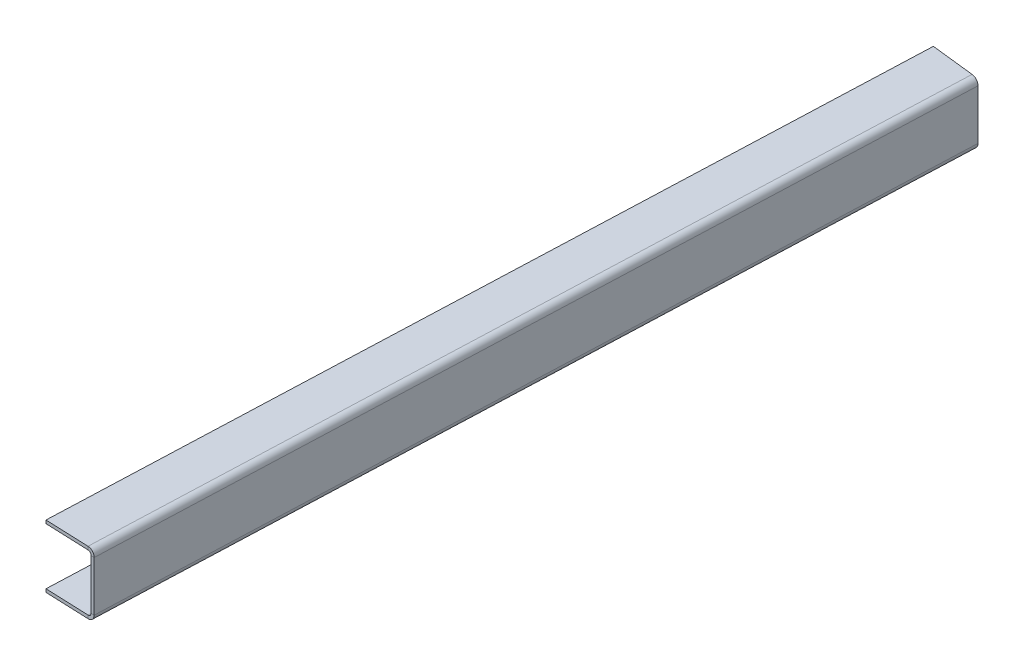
ISO-10303-21;
HEADER;
FILE_DESCRIPTION(('STEP AP214'),'2;1');
FILE_NAME('part.step','',(''),(''),'','','');
FILE_SCHEMA(('AUTOMOTIVE_DESIGN { 1 0 10303 214 1 1 1 1 }'));
ENDSEC;
DATA;
#1=APPLICATION_CONTEXT('core data for automotive mechanical design processes');
#2=APPLICATION_PROTOCOL_DEFINITION('international standard','automotive_design',2000,#1);
#3=PRODUCT_CONTEXT('',#1,'mechanical');
#4=PRODUCT('Part','Part','',(#3));
#5=PRODUCT_RELATED_PRODUCT_CATEGORY('part','',(#4));
#6=PRODUCT_DEFINITION_FORMATION('','',#4);
#7=PRODUCT_DEFINITION_CONTEXT('part definition',#1,'design');
#8=PRODUCT_DEFINITION('design','',#6,#7);
#9=PRODUCT_DEFINITION_SHAPE('','',#8);
#10=(LENGTH_UNIT() NAMED_UNIT(*) SI_UNIT(.MILLI.,.METRE.));
#11=(NAMED_UNIT(*) PLANE_ANGLE_UNIT() SI_UNIT($,.RADIAN.));
#12=(NAMED_UNIT(*) SI_UNIT($,.STERADIAN.) SOLID_ANGLE_UNIT());
#13=UNCERTAINTY_MEASURE_WITH_UNIT(LENGTH_MEASURE(1.E-05),#10,'distance_accuracy_value','');
#14=(GEOMETRIC_REPRESENTATION_CONTEXT(3) GLOBAL_UNCERTAINTY_ASSIGNED_CONTEXT((#13)) GLOBAL_UNIT_ASSIGNED_CONTEXT((#10,
#11,#12)) REPRESENTATION_CONTEXT('',''));
#15=CARTESIAN_POINT('',(0.,0.,0.));
#16=DIRECTION('',(0.,0.,1.));
#17=DIRECTION('',(1.,0.,0.));
#18=AXIS2_PLACEMENT_3D('',#15,#16,#17);
#19=CARTESIAN_POINT('',(554.128349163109,0.,-136.07871295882));
#20=DIRECTION('',(0.0392134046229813,0.,-0.999230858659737));
#21=DIRECTION('',(0.,1.,0.));
#22=AXIS2_PLACEMENT_3D('',#19,#20,#21);
#23=PLANE('',#22);
#24=DIRECTION('',(-0.999230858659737,0.,-0.0392134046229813));
#25=VECTOR('',#24,1.);
#26=CARTESIAN_POINT('',(554.128349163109,607.963803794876,-136.07871295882));
#27=LINE('',#26,#25);
#28=CARTESIAN_POINT('',(555.752698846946,607.963803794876,-136.014967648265));
#29=VERTEX_POINT('',#28);
#30=CARTESIAN_POINT('',(554.128349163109,607.963803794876,-136.07871295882));
#31=VERTEX_POINT('',#30);
#32=EDGE_CURVE('E12',#29,#31,#27,.T.);
#33=ORIENTED_EDGE('',*,*,#32,.F.);
#34=DIRECTION('',(0.,1.,0.));
#35=VECTOR('',#34,1.);
#36=CARTESIAN_POINT('',(555.752698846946,0.,-136.014967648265));
#37=LINE('',#36,#35);
#38=CARTESIAN_POINT('',(555.752698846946,633.211403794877,-136.014967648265));
#39=VERTEX_POINT('',#38);
#40=EDGE_CURVE('E137',#29,#39,#37,.T.);
#41=ORIENTED_EDGE('',*,*,#40,.T.);
#42=DIRECTION('',(-0.999230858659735,0.,-0.0392134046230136));
#43=VECTOR('',#42,1.);
#44=CARTESIAN_POINT('',(554.128349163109,633.211403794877,-136.07871295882));
#45=LINE('',#44,#43);
#46=CARTESIAN_POINT('',(554.128349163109,633.211403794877,-136.07871295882));
#47=VERTEX_POINT('',#46);
#48=EDGE_CURVE('E90',#39,#47,#45,.T.);
#49=ORIENTED_EDGE('',*,*,#48,.T.);
#50=DIRECTION('',(0.,1.,0.));
#51=VECTOR('',#50,1.);
#52=CARTESIAN_POINT('',(554.128349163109,0.,-136.07871295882));
#53=LINE('',#52,#51);
#54=EDGE_CURVE('E139',#31,#47,#53,.T.);
#55=ORIENTED_EDGE('',*,*,#54,.F.);
#56=EDGE_LOOP('',(#33,#41,#49,#55));
#57=FACE_BOUND('',#56,.T.);
#58=ADVANCED_FACE('F78',(#57),#23,.F.);
#59=CARTESIAN_POINT('',(550.879720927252,633.211403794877,-136.208016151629));
#60=CARTESIAN_POINT('',(550.33827103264,633.211403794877,-136.229264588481));
#61=CARTESIAN_POINT('',(549.796821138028,633.211403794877,-136.250513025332));
#62=CARTESIAN_POINT('',(549.255371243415,633.211403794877,-136.271761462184));
#63=CARTESIAN_POINT('',(550.879720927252,629.960203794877,-136.208016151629));
#64=CARTESIAN_POINT('',(550.33827103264,628.876470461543,-136.229264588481));
#65=CARTESIAN_POINT('',(549.796821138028,627.79273712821,-136.250513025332));
#66=CARTESIAN_POINT('',(549.255371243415,626.709003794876,-136.271761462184));
#67=CARTESIAN_POINT('',(554.128349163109,629.960203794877,-136.07871295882));
#68=CARTESIAN_POINT('',(554.669799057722,628.876470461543,-136.057464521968));
#69=CARTESIAN_POINT('',(555.211248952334,627.79273712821,-136.036216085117));
#70=CARTESIAN_POINT('',(555.752698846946,626.709003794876,-136.014967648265));
#71=CARTESIAN_POINT('',(554.128349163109,633.211403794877,-136.07871295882));
#72=CARTESIAN_POINT('',(554.669799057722,633.211403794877,-136.057464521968));
#73=CARTESIAN_POINT('',(555.211248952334,633.211403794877,-136.036216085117));
#74=CARTESIAN_POINT('',(555.752698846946,633.211403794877,-136.014967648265));
#75=CARTESIAN_POINT('',(554.128349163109,636.462603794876,-136.07871295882));
#76=CARTESIAN_POINT('',(554.669799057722,637.54633712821,-136.057464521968));
#77=CARTESIAN_POINT('',(555.211248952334,638.630070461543,-136.036216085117));
#78=CARTESIAN_POINT('',(555.752698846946,639.713803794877,-136.014967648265));
#79=CARTESIAN_POINT('',(550.879720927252,636.462603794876,-136.208016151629));
#80=CARTESIAN_POINT('',(550.33827103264,637.54633712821,-136.229264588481));
#81=CARTESIAN_POINT('',(549.796821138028,638.630070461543,-136.250513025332));
#82=CARTESIAN_POINT('',(549.255371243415,639.713803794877,-136.271761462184));
#83=CARTESIAN_POINT('',(550.879720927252,633.211403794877,-136.208016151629));
#84=CARTESIAN_POINT('',(550.33827103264,633.211403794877,-136.229264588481));
#85=CARTESIAN_POINT('',(549.796821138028,633.211403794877,-136.250513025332));
#86=CARTESIAN_POINT('',(549.255371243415,633.211403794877,-136.271761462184));
#87=(BOUNDED_SURFACE() B_SPLINE_SURFACE(3,3,((#59,#60,#61,#62),(#63,#64,#65,#66),(#67,#68,#69,
#70),(#71,#72,#73,#74),(#75,#76,#77,#78),(#79,#80,#81,#82),(#83,#84,#85,#86)),.UNSPECIFIED.,.T.,
.F.,.F.) B_SPLINE_SURFACE_WITH_KNOTS((4,3,4),(4,4),(0.,0.5,1.),(0.,1.),
.UNSPECIFIED.) GEOMETRIC_REPRESENTATION_ITEM() RATIONAL_B_SPLINE_SURFACE(((1.,1.,1.,1.),
(0.333333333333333,0.333333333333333,0.333333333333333,0.333333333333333),(0.333333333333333,
0.333333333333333,0.333333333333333,0.333333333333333),(1.,1.,1.,1.),(0.333333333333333,
0.333333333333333,0.333333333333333,0.333333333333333),(0.333333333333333,0.333333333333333,
0.333333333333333,0.333333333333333),(1.,1.,1.,1.))) REPRESENTATION_ITEM('') SURFACE());
#88=CARTESIAN_POINT('',(552.504035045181,633.211403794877,-136.143364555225));
#89=DIRECTION('',(-0.0394921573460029,0.,0.999219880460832));
#90=DIRECTION('',(-0.999219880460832,0.,-0.0394921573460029));
#91=AXIS2_PLACEMENT_3D('',#88,#89,#90);
#92=ELLIPSE('',#91,3.25120012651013,3.2512);
#93=CARTESIAN_POINT('',(552.504035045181,636.462603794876,-136.143364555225));
#94=VERTEX_POINT('',#93);
#95=EDGE_CURVE('E215',#39,#94,#92,.T.);
#96=DIRECTION('',(0.,-1.,0.));
#97=VECTOR('',#96,1.);
#98=CARTESIAN_POINT('',(552.504035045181,634.837003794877,-136.143364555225));
#99=LINE('',#98,#97);
#100=CARTESIAN_POINT('',(552.504035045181,634.837003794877,-136.143364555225));
#101=VERTEX_POINT('',#100);
#102=EDGE_CURVE('E205',#94,#101,#99,.T.);
#103=CARTESIAN_POINT('',(552.504035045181,633.211403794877,-136.143364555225));
#104=DIRECTION('',(-0.0397709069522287,0.,0.999208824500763));
#105=DIRECTION('',(-0.999208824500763,0.,-0.0397709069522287));
#106=AXIS2_PLACEMENT_3D('',#103,#104,#105);
#107=ELLIPSE('',#106,1.62560025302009,1.6256);
#108=EDGE_CURVE('E213',#47,#101,#107,.T.);
#109=ORIENTED_EDGE('',*,*,#48,.F.);
#110=ORIENTED_EDGE('',*,*,#95,.T.);
#111=ORIENTED_EDGE('',*,*,#102,.T.);
#112=ORIENTED_EDGE('',*,*,#108,.F.);
#113=EDGE_LOOP('',(#109,#110,#111,#112));
#114=FACE_BOUND('',#113,.T.);
#115=ADVANCED_FACE('F212',(#114),#87,.F.);
#116=CARTESIAN_POINT('',(530.368364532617,634.837003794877,-137.024417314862));
#117=DIRECTION('',(-0.0397709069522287,0.,0.999208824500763));
#118=DIRECTION('',(0.999208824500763,0.,0.0397709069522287));
#119=AXIS2_PLACEMENT_3D('',#116,#117,#118);
#120=PLANE('',#119);
#121=ORIENTED_EDGE('',*,*,#102,.F.);
#122=DIRECTION('',(0.999208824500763,0.,0.0397709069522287));
#123=VECTOR('',#122,1.);
#124=CARTESIAN_POINT('',(530.368364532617,636.462603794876,-137.024417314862));
#125=LINE('',#124,#123);
#126=CARTESIAN_POINT('',(530.368364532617,636.462603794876,-137.024417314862));
#127=VERTEX_POINT('',#126);
#128=EDGE_CURVE('E176',#127,#94,#125,.T.);
#129=ORIENTED_EDGE('',*,*,#128,.F.);
#130=DIRECTION('',(0.,-1.,0.));
#131=VECTOR('',#130,1.);
#132=CARTESIAN_POINT('',(530.368364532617,634.837003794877,-137.024417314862));
#133=LINE('',#132,#131);
#134=CARTESIAN_POINT('',(530.368364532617,634.837003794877,-137.024417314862));
#135=VERTEX_POINT('',#134);
#136=EDGE_CURVE('E202',#127,#135,#133,.T.);
#137=ORIENTED_EDGE('',*,*,#136,.T.);
#138=DIRECTION('',(0.999208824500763,0.,0.0397709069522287));
#139=VECTOR('',#138,1.);
#140=CARTESIAN_POINT('',(530.368364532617,634.837003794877,-137.024417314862));
#141=LINE('',#140,#139);
#142=EDGE_CURVE('E232',#135,#101,#141,.T.);
#143=ORIENTED_EDGE('',*,*,#142,.T.);
#144=EDGE_LOOP('',(#121,#129,#137,#143));
#145=FACE_BOUND('',#144,.T.);
#146=ADVANCED_FACE('F233',(#145),#120,.T.);
#147=CARTESIAN_POINT('',(547.31704522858,634.837003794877,-568.908486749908));
#148=DIRECTION('',(-0.999230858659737,0.,-0.0392134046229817));
#149=DIRECTION('',(-0.0392134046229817,0.,0.999230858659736));
#150=AXIS2_PLACEMENT_3D('',#147,#148,#149);
#151=PLANE('',#150);
#152=ORIENTED_EDGE('',*,*,#136,.F.);
#153=DIRECTION('',(-0.0392134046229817,0.,0.999230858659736));
#154=VECTOR('',#153,1.);
#155=CARTESIAN_POINT('',(547.31704522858,636.462603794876,-568.908486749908));
#156=LINE('',#155,#154);
#157=CARTESIAN_POINT('',(547.31704522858,636.462603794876,-568.908486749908));
#158=VERTEX_POINT('',#157);
#159=EDGE_CURVE('E168',#158,#127,#156,.T.);
#160=ORIENTED_EDGE('',*,*,#159,.F.);
#161=DIRECTION('',(0.,-1.,0.));
#162=VECTOR('',#161,1.);
#163=CARTESIAN_POINT('',(547.31704522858,634.837003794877,-568.908486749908));
#164=LINE('',#163,#162);
#165=CARTESIAN_POINT('',(547.31704522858,634.837003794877,-568.908486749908));
#166=VERTEX_POINT('',#165);
#167=EDGE_CURVE('E199',#158,#166,#164,.T.);
#168=ORIENTED_EDGE('',*,*,#167,.T.);
#169=DIRECTION('',(-0.0392134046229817,0.,0.999230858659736));
#170=VECTOR('',#169,1.);
#171=CARTESIAN_POINT('',(547.31704522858,634.837003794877,-568.908486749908));
#172=LINE('',#171,#170);
#173=EDGE_CURVE('E237',#166,#135,#172,.T.);
#174=ORIENTED_EDGE('',*,*,#173,.T.);
#175=EDGE_LOOP('',(#152,#160,#168,#174));
#176=FACE_BOUND('',#175,.T.);
#177=ADVANCED_FACE('F280',(#176),#151,.T.);
#178=CARTESIAN_POINT('',(572.624126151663,634.837003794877,-566.042533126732));
#179=DIRECTION('',(0.112527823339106,0.,-0.993648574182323));
#180=DIRECTION('',(-0.993648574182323,0.,-0.112527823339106));
#181=AXIS2_PLACEMENT_3D('',#178,#179,#180);
#182=PLANE('',#181);
#183=ORIENTED_EDGE('',*,*,#167,.F.);
#184=DIRECTION('',(-0.993648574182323,0.,-0.112527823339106));
#185=VECTOR('',#184,1.);
#186=CARTESIAN_POINT('',(572.624126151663,636.462603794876,-566.042533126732));
#187=LINE('',#186,#185);
#188=CARTESIAN_POINT('',(569.389197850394,636.462603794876,-566.408879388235));
#189=VERTEX_POINT('',#188);
#190=EDGE_CURVE('E173',#189,#158,#187,.T.);
#191=ORIENTED_EDGE('',*,*,#190,.F.);
#192=DIRECTION('',(0.,-1.,-1.36592399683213E-13));
#193=VECTOR('',#192,1.);
#194=CARTESIAN_POINT('',(569.389197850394,634.837003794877,-566.408879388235));
#195=LINE('',#194,#193);
#196=CARTESIAN_POINT('',(569.389197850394,634.837003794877,-566.408879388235));
#197=VERTEX_POINT('',#196);
#198=EDGE_CURVE('E196',#189,#197,#195,.T.);
#199=ORIENTED_EDGE('',*,*,#198,.T.);
#200=DIRECTION('',(-0.993648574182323,0.,-0.112527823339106));
#201=VECTOR('',#200,1.);
#202=CARTESIAN_POINT('',(572.624126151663,634.837003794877,-566.042533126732));
#203=LINE('',#202,#201);
#204=EDGE_CURVE('E238',#197,#166,#203,.T.);
#205=ORIENTED_EDGE('',*,*,#204,.T.);
#206=EDGE_LOOP('',(#183,#191,#199,#205));
#207=FACE_BOUND('',#206,.T.);
#208=ADVANCED_FACE('F307',(#207),#182,.T.);
#209=CARTESIAN_POINT('',(567.769544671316,633.211403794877,-566.592300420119));
#210=CARTESIAN_POINT('',(567.228094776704,633.211403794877,-566.61354885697));
#211=CARTESIAN_POINT('',(566.686644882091,633.211403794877,-566.634797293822));
#212=CARTESIAN_POINT('',(566.145194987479,633.211403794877,-566.656045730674));
#213=CARTESIAN_POINT('',(567.769544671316,636.462603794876,-566.592300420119));
#214=CARTESIAN_POINT('',(567.228094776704,637.54633712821,-566.613548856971));
#215=CARTESIAN_POINT('',(566.686644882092,638.630070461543,-566.634797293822));
#216=CARTESIAN_POINT('',(566.145194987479,639.713803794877,-566.656045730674));
#217=CARTESIAN_POINT('',(571.008851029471,636.462603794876,-566.225458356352));
#218=CARTESIAN_POINT('',(571.550300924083,637.54633712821,-566.204209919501));
#219=CARTESIAN_POINT('',(572.091750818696,638.630070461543,-566.182961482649));
#220=CARTESIAN_POINT('',(572.633200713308,639.713803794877,-566.161713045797));
#221=CARTESIAN_POINT('',(571.008851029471,633.211403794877,-566.225458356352));
#222=CARTESIAN_POINT('',(571.550300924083,633.211403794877,-566.2042099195));
#223=CARTESIAN_POINT('',(572.091750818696,633.211403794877,-566.182961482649));
#224=CARTESIAN_POINT('',(572.633200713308,633.211403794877,-566.161713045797));
#225=CARTESIAN_POINT('',(571.008851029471,629.960203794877,-566.225458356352));
#226=CARTESIAN_POINT('',(571.550300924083,628.876470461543,-566.204209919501));
#227=CARTESIAN_POINT('',(572.091750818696,627.79273712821,-566.182961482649));
#228=CARTESIAN_POINT('',(572.633200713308,626.709003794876,-566.161713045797));
#229=CARTESIAN_POINT('',(567.769544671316,629.960203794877,-566.592300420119));
#230=CARTESIAN_POINT('',(567.228094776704,628.876470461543,-566.613548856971));
#231=CARTESIAN_POINT('',(566.686644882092,627.79273712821,-566.634797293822));
#232=CARTESIAN_POINT('',(566.145194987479,626.709003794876,-566.656045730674));
#233=CARTESIAN_POINT('',(567.769544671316,633.211403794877,-566.592300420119));
#234=CARTESIAN_POINT('',(567.228094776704,633.211403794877,-566.61354885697));
#235=CARTESIAN_POINT('',(566.686644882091,633.211403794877,-566.634797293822));
#236=CARTESIAN_POINT('',(566.145194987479,633.211403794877,-566.656045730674));
#237=(BOUNDED_SURFACE() B_SPLINE_SURFACE(3,3,((#209,#210,#211,#212),(#213,#214,#215,#216),(#217,
#218,#219,#220),(#221,#222,#223,#224),(#225,#226,#227,#228),(#229,#230,#231,#232),(#233,#234,
#235,#236)),.UNSPECIFIED.,.T.,.F.,.F.) B_SPLINE_SURFACE_WITH_KNOTS((4,3,4),(4,4),(0.,0.5,1.),
(0.,1.),.UNSPECIFIED.) GEOMETRIC_REPRESENTATION_ITEM() RATIONAL_B_SPLINE_SURFACE(((1.,1.,1.,1.),
(0.333333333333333,0.333333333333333,0.333333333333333,0.333333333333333),(0.333333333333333,
0.333333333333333,0.333333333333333,0.333333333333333),(1.,1.,1.,1.),(0.333333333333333,
0.333333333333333,0.333333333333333,0.333333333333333),(0.333333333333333,0.333333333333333,
0.333333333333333,0.333333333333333),(1.,1.,1.,1.))) REPRESENTATION_ITEM('') SURFACE());
#238=CARTESIAN_POINT('',(569.389197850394,633.211403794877,-566.408879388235));
#239=DIRECTION('',(0.0759715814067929,0.,-0.997109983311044));
#240=DIRECTION('',(-0.997109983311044,0.,-0.0759715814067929));
#241=AXIS2_PLACEMENT_3D('',#238,#239,#240);
#242=ELLIPSE('',#241,3.25340525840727,3.2512);
#243=CARTESIAN_POINT('',(572.633200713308,633.211403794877,-566.161713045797));
#244=VERTEX_POINT('',#243);
#245=EDGE_CURVE('E178',#189,#244,#242,.T.);
#246=DIRECTION('',(-0.999230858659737,0.,-0.0392134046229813));
#247=VECTOR('',#246,1.);
#248=CARTESIAN_POINT('',(571.008851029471,633.211403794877,-566.225458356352));
#249=LINE('',#248,#247);
#250=CARTESIAN_POINT('',(571.008851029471,633.211403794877,-566.225458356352));
#251=VERTEX_POINT('',#250);
#252=EDGE_CURVE('E194',#244,#251,#249,.T.);
#253=CARTESIAN_POINT('',(569.389197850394,633.211403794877,-566.408879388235));
#254=DIRECTION('',(0.112527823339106,0.,-0.993648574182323));
#255=DIRECTION('',(-0.993648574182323,0.,-0.112527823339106));
#256=AXIS2_PLACEMENT_3D('',#253,#254,#255);
#257=ELLIPSE('',#256,1.63000604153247,1.6256);
#258=EDGE_CURVE('E229',#197,#251,#257,.T.);
#259=ORIENTED_EDGE('',*,*,#198,.F.);
#260=ORIENTED_EDGE('',*,*,#245,.T.);
#261=ORIENTED_EDGE('',*,*,#252,.T.);
#262=ORIENTED_EDGE('',*,*,#258,.F.);
#263=EDGE_LOOP('',(#259,#260,#261,#262));
#264=FACE_BOUND('',#263,.T.);
#265=ADVANCED_FACE('F357',(#264),#237,.F.);
#266=CARTESIAN_POINT('',(571.008851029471,0.,-566.225458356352));
#267=DIRECTION('',(-0.0392134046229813,0.,0.999230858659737));
#268=DIRECTION('',(0.,-1.,0.));
#269=AXIS2_PLACEMENT_3D('',#266,#267,#268);
#270=PLANE('',#269);
#271=ORIENTED_EDGE('',*,*,#252,.F.);
#272=DIRECTION('',(0.,1.,0.));
#273=VECTOR('',#272,1.);
#274=CARTESIAN_POINT('',(572.633200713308,0.,-566.161713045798));
#275=LINE('',#274,#273);
#276=CARTESIAN_POINT('',(572.633200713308,607.963803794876,-566.161713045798));
#277=VERTEX_POINT('',#276);
#278=EDGE_CURVE('E167',#244,#277,#275,.F.);
#279=ORIENTED_EDGE('',*,*,#278,.T.);
#280=DIRECTION('',(-0.999230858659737,0.,-0.0392134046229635));
#281=VECTOR('',#280,1.);
#282=CARTESIAN_POINT('',(571.008851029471,607.963803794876,-566.225458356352));
#283=LINE('',#282,#281);
#284=CARTESIAN_POINT('',(571.008851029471,607.963803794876,-566.225458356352));
#285=VERTEX_POINT('',#284);
#286=EDGE_CURVE('E191',#277,#285,#283,.T.);
#287=ORIENTED_EDGE('',*,*,#286,.T.);
#288=DIRECTION('',(0.,-1.,0.));
#289=VECTOR('',#288,1.);
#290=CARTESIAN_POINT('',(571.008851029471,0.,-566.225458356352));
#291=LINE('',#290,#289);
#292=EDGE_CURVE('E284',#251,#285,#291,.T.);
#293=ORIENTED_EDGE('',*,*,#292,.F.);
#294=EDGE_LOOP('',(#271,#279,#287,#293));
#295=FACE_BOUND('',#294,.T.);
#296=ADVANCED_FACE('F322',(#295),#270,.F.);
#297=CARTESIAN_POINT('',(571.008851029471,607.963803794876,-566.225458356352));
#298=CARTESIAN_POINT('',(571.550300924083,607.963803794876,-566.204209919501));
#299=CARTESIAN_POINT('',(572.091750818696,607.963803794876,-566.182961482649));
#300=CARTESIAN_POINT('',(572.633200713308,607.963803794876,-566.161713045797));
#301=CARTESIAN_POINT('',(571.008851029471,604.712603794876,-566.225458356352));
#302=CARTESIAN_POINT('',(571.550300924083,603.628870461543,-566.204209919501));
#303=CARTESIAN_POINT('',(572.091750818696,602.54513712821,-566.182961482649));
#304=CARTESIAN_POINT('',(572.633200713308,601.461403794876,-566.161713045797));
#305=CARTESIAN_POINT('',(567.769544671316,604.712603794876,-566.592300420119));
#306=CARTESIAN_POINT('',(567.228094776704,603.628870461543,-566.613548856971));
#307=CARTESIAN_POINT('',(566.686644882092,602.54513712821,-566.634797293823));
#308=CARTESIAN_POINT('',(566.145194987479,601.461403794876,-566.656045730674));
#309=CARTESIAN_POINT('',(567.769544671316,607.963803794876,-566.592300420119));
#310=CARTESIAN_POINT('',(567.228094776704,607.963803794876,-566.613548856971));
#311=CARTESIAN_POINT('',(566.686644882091,607.963803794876,-566.634797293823));
#312=CARTESIAN_POINT('',(566.145194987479,607.963803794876,-566.656045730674));
#313=CARTESIAN_POINT('',(567.769544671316,611.215003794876,-566.592300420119));
#314=CARTESIAN_POINT('',(567.228094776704,612.29873712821,-566.613548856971));
#315=CARTESIAN_POINT('',(566.686644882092,613.382470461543,-566.634797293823));
#316=CARTESIAN_POINT('',(566.145194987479,614.466203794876,-566.656045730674));
#317=CARTESIAN_POINT('',(571.008851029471,611.215003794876,-566.225458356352));
#318=CARTESIAN_POINT('',(571.550300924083,612.29873712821,-566.204209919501));
#319=CARTESIAN_POINT('',(572.091750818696,613.382470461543,-566.182961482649));
#320=CARTESIAN_POINT('',(572.633200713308,614.466203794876,-566.161713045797));
#321=CARTESIAN_POINT('',(571.008851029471,607.963803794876,-566.225458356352));
#322=CARTESIAN_POINT('',(571.550300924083,607.963803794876,-566.204209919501));
#323=CARTESIAN_POINT('',(572.091750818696,607.963803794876,-566.182961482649));
#324=CARTESIAN_POINT('',(572.633200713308,607.963803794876,-566.161713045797));
#325=(BOUNDED_SURFACE() B_SPLINE_SURFACE(3,3,((#297,#298,#299,#300),(#301,#302,#303,#304),(#305,
#306,#307,#308),(#309,#310,#311,#312),(#313,#314,#315,#316),(#317,#318,#319,#320),(#321,#322,
#323,#324)),.UNSPECIFIED.,.T.,.F.,.F.) B_SPLINE_SURFACE_WITH_KNOTS((4,3,4),(4,4),(0.,0.5,1.),
(0.,1.),.UNSPECIFIED.) GEOMETRIC_REPRESENTATION_ITEM() RATIONAL_B_SPLINE_SURFACE(((1.,1.,1.,1.),
(0.333333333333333,0.333333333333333,0.333333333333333,0.333333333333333),(0.333333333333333,
0.333333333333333,0.333333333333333,0.333333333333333),(1.,1.,1.,1.),(0.333333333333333,
0.333333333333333,0.333333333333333,0.333333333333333),(0.333333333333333,0.333333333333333,
0.333333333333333,0.333333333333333),(1.,1.,1.,1.))) REPRESENTATION_ITEM('') SURFACE());
#326=CARTESIAN_POINT('',(569.389197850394,607.963803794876,-566.408879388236));
#327=DIRECTION('',(0.0759715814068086,0.,-0.997109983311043));
#328=DIRECTION('',(0.997109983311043,0.,0.0759715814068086));
#329=AXIS2_PLACEMENT_3D('',#326,#327,#328);
#330=ELLIPSE('',#329,3.25340525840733,3.2512);
#331=CARTESIAN_POINT('',(569.389197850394,604.712603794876,-566.408879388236));
#332=VERTEX_POINT('',#331);
#333=EDGE_CURVE('E155',#277,#332,#330,.T.);
#334=DIRECTION('',(0.,1.,0.));
#335=VECTOR('',#334,1.);
#336=CARTESIAN_POINT('',(569.389197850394,606.338203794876,-566.408879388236));
#337=LINE('',#336,#335);
#338=CARTESIAN_POINT('',(569.389197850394,606.338203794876,-566.408879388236));
#339=VERTEX_POINT('',#338);
#340=EDGE_CURVE('E188',#332,#339,#337,.T.);
#341=CARTESIAN_POINT('',(569.389197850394,607.963803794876,-566.408879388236));
#342=DIRECTION('',(0.112527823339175,0.,-0.993648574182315));
#343=DIRECTION('',(0.993648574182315,0.,0.112527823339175));
#344=AXIS2_PLACEMENT_3D('',#341,#342,#343);
#345=ELLIPSE('',#344,1.63000604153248,1.6256);
#346=EDGE_CURVE('E254',#285,#339,#345,.T.);
#347=ORIENTED_EDGE('',*,*,#286,.F.);
#348=ORIENTED_EDGE('',*,*,#333,.T.);
#349=ORIENTED_EDGE('',*,*,#340,.T.);
#350=ORIENTED_EDGE('',*,*,#346,.F.);
#351=EDGE_LOOP('',(#347,#348,#349,#350));
#352=FACE_BOUND('',#351,.T.);
#353=ADVANCED_FACE('F326',(#352),#325,.F.);
#354=CARTESIAN_POINT('',(547.31704522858,606.338203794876,-568.908486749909));
#355=DIRECTION('',(0.112527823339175,0.,-0.993648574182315));
#356=DIRECTION('',(0.993648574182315,0.,0.112527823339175));
#357=AXIS2_PLACEMENT_3D('',#354,#355,#356);
#358=PLANE('',#357);
#359=ORIENTED_EDGE('',*,*,#340,.F.);
#360=DIRECTION('',(0.993648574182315,0.,0.112527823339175));
#361=VECTOR('',#360,1.);
#362=CARTESIAN_POINT('',(547.31704522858,604.712603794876,-568.908486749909));
#363=LINE('',#362,#361);
#364=CARTESIAN_POINT('',(547.317045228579,604.712603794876,-568.908486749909));
#365=VERTEX_POINT('',#364);
#366=EDGE_CURVE('E262',#365,#332,#363,.T.);
#367=ORIENTED_EDGE('',*,*,#366,.F.);
#368=DIRECTION('',(0.,1.,0.));
#369=VECTOR('',#368,1.);
#370=CARTESIAN_POINT('',(547.31704522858,606.338203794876,-568.908486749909));
#371=LINE('',#370,#369);
#372=CARTESIAN_POINT('',(547.31704522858,606.338203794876,-568.908486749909));
#373=VERTEX_POINT('',#372);
#374=EDGE_CURVE('E185',#365,#373,#371,.T.);
#375=ORIENTED_EDGE('',*,*,#374,.T.);
#376=DIRECTION('',(0.993648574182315,0.,0.112527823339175));
#377=VECTOR('',#376,1.);
#378=CARTESIAN_POINT('',(547.31704522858,606.338203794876,-568.908486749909));
#379=LINE('',#378,#377);
#380=EDGE_CURVE('E293',#373,#339,#379,.T.);
#381=ORIENTED_EDGE('',*,*,#380,.T.);
#382=EDGE_LOOP('',(#359,#367,#375,#381));
#383=FACE_BOUND('',#382,.T.);
#384=ADVANCED_FACE('F374',(#383),#358,.T.);
#385=CARTESIAN_POINT('',(530.368364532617,606.338203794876,-137.02441731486));
#386=DIRECTION('',(-0.999230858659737,0.,-0.0392134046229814));
#387=DIRECTION('',(0.0392134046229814,0.,-0.999230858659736));
#388=AXIS2_PLACEMENT_3D('',#385,#386,#387);
#389=PLANE('',#388);
#390=ORIENTED_EDGE('',*,*,#374,.F.);
#391=DIRECTION('',(0.0392134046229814,0.,-0.999230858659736));
#392=VECTOR('',#391,1.);
#393=CARTESIAN_POINT('',(530.368364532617,604.712603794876,-137.02441731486));
#394=LINE('',#393,#392);
#395=CARTESIAN_POINT('',(530.368364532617,604.712603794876,-137.02441731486));
#396=VERTEX_POINT('',#395);
#397=EDGE_CURVE('E255',#396,#365,#394,.T.);
#398=ORIENTED_EDGE('',*,*,#397,.F.);
#399=DIRECTION('',(0.,1.,0.));
#400=VECTOR('',#399,1.);
#401=CARTESIAN_POINT('',(530.368364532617,606.338203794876,-137.02441731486));
#402=LINE('',#401,#400);
#403=CARTESIAN_POINT('',(530.368364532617,606.338203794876,-137.02441731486));
#404=VERTEX_POINT('',#403);
#405=EDGE_CURVE('E182',#396,#404,#402,.T.);
#406=ORIENTED_EDGE('',*,*,#405,.T.);
#407=DIRECTION('',(0.0392134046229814,0.,-0.999230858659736));
#408=VECTOR('',#407,1.);
#409=CARTESIAN_POINT('',(530.368364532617,606.338203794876,-137.02441731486));
#410=LINE('',#409,#408);
#411=EDGE_CURVE('E296',#404,#373,#410,.T.);
#412=ORIENTED_EDGE('',*,*,#411,.T.);
#413=EDGE_LOOP('',(#390,#398,#406,#412));
#414=FACE_BOUND('',#413,.T.);
#415=ADVANCED_FACE('F382',(#414),#389,.T.);
#416=CARTESIAN_POINT('',(555.748272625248,606.338203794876,-136.014236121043));
#417=DIRECTION('',(-0.0397709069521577,0.,0.999208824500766));
#418=DIRECTION('',(-0.999208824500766,0.,-0.0397709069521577));
#419=AXIS2_PLACEMENT_3D('',#416,#417,#418);
#420=PLANE('',#419);
#421=ORIENTED_EDGE('',*,*,#405,.F.);
#422=DIRECTION('',(-0.999208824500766,0.,-0.0397709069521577));
#423=VECTOR('',#422,1.);
#424=CARTESIAN_POINT('',(555.748272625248,604.712603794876,-136.014236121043));
#425=LINE('',#424,#423);
#426=CARTESIAN_POINT('',(552.504035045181,604.712603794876,-136.143364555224));
#427=VERTEX_POINT('',#426);
#428=EDGE_CURVE('E259',#427,#396,#425,.T.);
#429=ORIENTED_EDGE('',*,*,#428,.F.);
#430=DIRECTION('',(0.,1.,0.));
#431=VECTOR('',#430,1.);
#432=CARTESIAN_POINT('',(552.504035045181,606.338203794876,-136.143364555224));
#433=LINE('',#432,#431);
#434=CARTESIAN_POINT('',(552.504035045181,606.338203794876,-136.143364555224));
#435=VERTEX_POINT('',#434);
#436=EDGE_CURVE('E84',#427,#435,#433,.T.);
#437=ORIENTED_EDGE('',*,*,#436,.T.);
#438=DIRECTION('',(-0.999208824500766,0.,-0.0397709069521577));
#439=VECTOR('',#438,1.);
#440=CARTESIAN_POINT('',(555.748272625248,606.338203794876,-136.014236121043));
#441=LINE('',#440,#439);
#442=EDGE_CURVE('E290',#435,#404,#441,.T.);
#443=ORIENTED_EDGE('',*,*,#442,.T.);
#444=EDGE_LOOP('',(#421,#429,#437,#443));
#445=FACE_BOUND('',#444,.T.);
#446=ADVANCED_FACE('F386',(#445),#420,.T.);
#447=CARTESIAN_POINT('',(554.128349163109,607.963803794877,-136.07871295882));
#448=CARTESIAN_POINT('',(554.669799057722,607.963803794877,-136.057464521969));
#449=CARTESIAN_POINT('',(555.211248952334,607.963803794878,-136.036216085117));
#450=CARTESIAN_POINT('',(555.752698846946,607.963803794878,-136.014967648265));
#451=CARTESIAN_POINT('',(554.128349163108,611.215003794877,-136.07871295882));
#452=CARTESIAN_POINT('',(554.66979905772,612.298737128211,-136.057464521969));
#453=CARTESIAN_POINT('',(555.211248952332,613.382470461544,-136.036216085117));
#454=CARTESIAN_POINT('',(555.752698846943,614.466203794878,-136.014967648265));
#455=CARTESIAN_POINT('',(550.879720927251,611.215003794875,-136.208016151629));
#456=CARTESIAN_POINT('',(550.338271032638,612.298737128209,-136.229264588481));
#457=CARTESIAN_POINT('',(549.796821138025,613.382470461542,-136.250513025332));
#458=CARTESIAN_POINT('',(549.255371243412,614.466203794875,-136.271761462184));
#459=CARTESIAN_POINT('',(550.879720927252,607.963803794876,-136.208016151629));
#460=CARTESIAN_POINT('',(550.33827103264,607.963803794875,-136.22926458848));
#461=CARTESIAN_POINT('',(549.796821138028,607.963803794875,-136.250513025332));
#462=CARTESIAN_POINT('',(549.255371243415,607.963803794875,-136.271761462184));
#463=CARTESIAN_POINT('',(550.879720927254,604.712603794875,-136.208016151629));
#464=CARTESIAN_POINT('',(550.338271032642,603.628870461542,-136.22926458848));
#465=CARTESIAN_POINT('',(549.79682113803,602.545137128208,-136.250513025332));
#466=CARTESIAN_POINT('',(549.255371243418,601.461403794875,-136.271761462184));
#467=CARTESIAN_POINT('',(554.128349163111,604.712603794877,-136.07871295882));
#468=CARTESIAN_POINT('',(554.669799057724,603.628870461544,-136.057464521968));
#469=CARTESIAN_POINT('',(555.211248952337,602.545137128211,-136.036216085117));
#470=CARTESIAN_POINT('',(555.75269884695,601.461403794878,-136.014967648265));
#471=CARTESIAN_POINT('',(554.128349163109,607.963803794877,-136.07871295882));
#472=CARTESIAN_POINT('',(554.669799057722,607.963803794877,-136.057464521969));
#473=CARTESIAN_POINT('',(555.211248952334,607.963803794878,-136.036216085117));
#474=CARTESIAN_POINT('',(555.752698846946,607.963803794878,-136.014967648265));
#475=(BOUNDED_SURFACE() B_SPLINE_SURFACE(3,3,((#447,#448,#449,#450),(#451,#452,#453,#454),(#455,
#456,#457,#458),(#459,#460,#461,#462),(#463,#464,#465,#466),(#467,#468,#469,#470),(#471,#472,
#473,#474)),.UNSPECIFIED.,.T.,.F.,.F.) B_SPLINE_SURFACE_WITH_KNOTS((4,3,4),(4,4),(0.,0.5,1.),
(0.,1.),.UNSPECIFIED.) GEOMETRIC_REPRESENTATION_ITEM() RATIONAL_B_SPLINE_SURFACE(((1.,1.,1.,1.),
(0.333333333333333,0.333333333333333,0.333333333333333,0.333333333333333),(0.333333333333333,
0.333333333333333,0.333333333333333,0.333333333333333),(1.,1.,1.,1.),(0.333333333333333,
0.333333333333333,0.333333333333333,0.333333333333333),(0.333333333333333,0.333333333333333,
0.333333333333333,0.333333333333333),(1.,1.,1.,1.))) REPRESENTATION_ITEM('') SURFACE());
#476=CARTESIAN_POINT('',(552.504035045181,607.963803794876,-136.143364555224));
#477=DIRECTION('',(-0.0394921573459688,0.,0.999219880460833));
#478=DIRECTION('',(0.999219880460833,4.78073380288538E-13,0.0394921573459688));
#479=AXIS2_PLACEMENT_3D('',#476,#477,#478);
#480=ELLIPSE('',#479,3.25120012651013,3.2512);
#481=EDGE_CURVE('E152',#427,#29,#480,.T.);
#482=CARTESIAN_POINT('',(552.504035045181,607.963803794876,-136.143364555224));
#483=DIRECTION('',(-0.0397709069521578,0.,0.999208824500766));
#484=DIRECTION('',(0.999208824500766,4.62374026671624E-13,0.0397709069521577));
#485=AXIS2_PLACEMENT_3D('',#482,#483,#484);
#486=ELLIPSE('',#485,1.62560025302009,1.6256);
#487=EDGE_CURVE('E250',#435,#31,#486,.T.);
#488=ORIENTED_EDGE('',*,*,#481,.T.);
#489=ORIENTED_EDGE('',*,*,#32,.T.);
#490=ORIENTED_EDGE('',*,*,#487,.F.);
#491=ORIENTED_EDGE('',*,*,#436,.F.);
#492=EDGE_LOOP('',(#488,#489,#490,#491));
#493=FACE_BOUND('',#492,.T.);
#494=ADVANCED_FACE('F80',(#493),#475,.F.);
#495=CARTESIAN_POINT('',(0.,606.338203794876,-1.51167296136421E-13));
#496=DIRECTION('',(0.,-1.,0.));
#497=DIRECTION('',(0.,0.,-1.));
#498=AXIS2_PLACEMENT_3D('',#495,#496,#497);
#499=PLANE('',#498);
#500=ORIENTED_EDGE('',*,*,#442,.F.);
#501=DIRECTION('',(0.0392134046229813,0.,-0.999230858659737));
#502=VECTOR('',#501,1.);
#503=CARTESIAN_POINT('',(569.384501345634,606.338203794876,-566.289203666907));
#504=LINE('',#503,#502);
#505=EDGE_CURVE('E247',#435,#339,#504,.T.);
#506=ORIENTED_EDGE('',*,*,#505,.T.);
#507=ORIENTED_EDGE('',*,*,#380,.F.);
#508=ORIENTED_EDGE('',*,*,#411,.F.);
#509=EDGE_LOOP('',(#500,#506,#507,#508));
#510=FACE_BOUND('',#509,.T.);
#511=ADVANCED_FACE('F411',(#510),#499,.F.);
#512=CARTESIAN_POINT('',(547.94660742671,0.,21.4436231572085));
#513=DIRECTION('',(0.999230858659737,0.,0.0392134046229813));
#514=DIRECTION('',(0.0392134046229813,0.,-0.999230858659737));
#515=AXIS2_PLACEMENT_3D('',#512,#513,#514);
#516=PLANE('',#515);
#517=ORIENTED_EDGE('',*,*,#54,.T.);
#518=DIRECTION('',(-0.0392134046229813,0.,0.999230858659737));
#519=VECTOR('',#518,1.);
#520=CARTESIAN_POINT('',(571.008851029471,633.211403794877,-566.225458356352));
#521=LINE('',#520,#519);
#522=EDGE_CURVE('E228',#47,#251,#521,.F.);
#523=ORIENTED_EDGE('',*,*,#522,.T.);
#524=ORIENTED_EDGE('',*,*,#292,.T.);
#525=DIRECTION('',(0.0392134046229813,0.,-0.999230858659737));
#526=VECTOR('',#525,1.);
#527=CARTESIAN_POINT('',(554.128349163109,607.963803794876,-136.07871295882));
#528=LINE('',#527,#526);
#529=EDGE_CURVE('E244',#285,#31,#528,.F.);
#530=ORIENTED_EDGE('',*,*,#529,.T.);
#531=EDGE_LOOP('',(#517,#523,#524,#530));
#532=FACE_BOUND('',#531,.T.);
#533=ADVANCED_FACE('F325',(#532),#516,.F.);
#534=CARTESIAN_POINT('',(0.,634.837003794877,0.));
#535=DIRECTION('',(0.,1.,0.));
#536=DIRECTION('',(0.,0.,1.));
#537=AXIS2_PLACEMENT_3D('',#534,#535,#536);
#538=PLANE('',#537);
#539=ORIENTED_EDGE('',*,*,#204,.F.);
#540=DIRECTION('',(-0.0392134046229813,0.,0.999230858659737));
#541=VECTOR('',#540,1.);
#542=CARTESIAN_POINT('',(552.503999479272,634.837003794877,-136.142458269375));
#543=LINE('',#542,#541);
#544=EDGE_CURVE('E226',#197,#101,#543,.T.);
#545=ORIENTED_EDGE('',*,*,#544,.T.);
#546=ORIENTED_EDGE('',*,*,#142,.F.);
#547=ORIENTED_EDGE('',*,*,#173,.F.);
#548=EDGE_LOOP('',(#539,#545,#546,#547));
#549=FACE_BOUND('',#548,.T.);
#550=ADVANCED_FACE('F241',(#549),#538,.F.);
#551=CARTESIAN_POINT('',(546.319915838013,607.963803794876,21.4395539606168));
#552=DIRECTION('',(-0.0392134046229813,0.,0.999230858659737));
#553=DIRECTION('',(0.999230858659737,0.,0.0392134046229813));
#554=AXIS2_PLACEMENT_3D('',#551,#552,#553);
#555=CYLINDRICAL_SURFACE('',#554,1.6256);
#556=ORIENTED_EDGE('',*,*,#487,.T.);
#557=ORIENTED_EDGE('',*,*,#529,.F.);
#558=ORIENTED_EDGE('',*,*,#346,.T.);
#559=ORIENTED_EDGE('',*,*,#505,.F.);
#560=EDGE_LOOP('',(#556,#557,#558,#559));
#561=FACE_BOUND('',#560,.T.);
#562=ADVANCED_FACE('F327',(#561),#555,.F.);
#563=CARTESIAN_POINT('',(546.319915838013,633.211403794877,21.439553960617));
#564=DIRECTION('',(0.0392134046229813,0.,-0.999230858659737));
#565=DIRECTION('',(-0.999230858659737,0.,-0.0392134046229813));
#566=AXIS2_PLACEMENT_3D('',#563,#564,#565);
#567=CYLINDRICAL_SURFACE('',#566,1.6256);
#568=ORIENTED_EDGE('',*,*,#258,.T.);
#569=ORIENTED_EDGE('',*,*,#522,.F.);
#570=ORIENTED_EDGE('',*,*,#108,.T.);
#571=ORIENTED_EDGE('',*,*,#544,.F.);
#572=EDGE_LOOP('',(#568,#569,#570,#571));
#573=FACE_BOUND('',#572,.T.);
#574=ADVANCED_FACE('F224',(#573),#567,.F.);
#575=CARTESIAN_POINT('',(0.,604.712603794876,-1.50749464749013E-13));
#576=DIRECTION('',(0.,-1.,0.));
#577=DIRECTION('',(0.,0.,-1.));
#578=AXIS2_PLACEMENT_3D('',#575,#576,#577);
#579=PLANE('',#578);
#580=ORIENTED_EDGE('',*,*,#428,.T.);
#581=ORIENTED_EDGE('',*,*,#397,.T.);
#582=ORIENTED_EDGE('',*,*,#366,.T.);
#583=DIRECTION('',(-0.0392134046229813,0.,0.999230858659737));
#584=VECTOR('',#583,1.);
#585=CARTESIAN_POINT('',(546.319915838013,604.712603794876,21.4395539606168));
#586=LINE('',#585,#584);
#587=EDGE_CURVE('E160',#427,#332,#586,.F.);
#588=ORIENTED_EDGE('',*,*,#587,.F.);
#589=EDGE_LOOP('',(#580,#581,#582,#588));
#590=FACE_BOUND('',#589,.T.);
#591=ADVANCED_FACE('F334',(#590),#579,.T.);
#592=CARTESIAN_POINT('',(549.570957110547,0.,21.5073684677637));
#593=DIRECTION('',(0.999230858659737,0.,0.0392134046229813));
#594=DIRECTION('',(0.0392134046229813,0.,-0.999230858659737));
#595=AXIS2_PLACEMENT_3D('',#592,#593,#594);
#596=PLANE('',#595);
#597=ORIENTED_EDGE('',*,*,#40,.F.);
#598=DIRECTION('',(0.0392134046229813,0.,-0.999230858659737));
#599=VECTOR('',#598,1.);
#600=CARTESIAN_POINT('',(549.570957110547,607.963803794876,21.5073684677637));
#601=LINE('',#600,#599);
#602=EDGE_CURVE('E149',#277,#29,#601,.F.);
#603=ORIENTED_EDGE('',*,*,#602,.F.);
#604=ORIENTED_EDGE('',*,*,#278,.F.);
#605=DIRECTION('',(0.0392134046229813,0.,-0.999230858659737));
#606=VECTOR('',#605,1.);
#607=CARTESIAN_POINT('',(549.570957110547,633.211403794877,21.5073684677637));
#608=LINE('',#607,#606);
#609=EDGE_CURVE('E165',#39,#244,#608,.T.);
#610=ORIENTED_EDGE('',*,*,#609,.F.);
#611=EDGE_LOOP('',(#597,#603,#604,#610));
#612=FACE_BOUND('',#611,.T.);
#613=ADVANCED_FACE('F163',(#612),#596,.T.);
#614=CARTESIAN_POINT('',(0.,636.462603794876,0.));
#615=DIRECTION('',(0.,1.,0.));
#616=DIRECTION('',(0.,0.,1.));
#617=AXIS2_PLACEMENT_3D('',#614,#615,#616);
#618=PLANE('',#617);
#619=ORIENTED_EDGE('',*,*,#190,.T.);
#620=ORIENTED_EDGE('',*,*,#159,.T.);
#621=ORIENTED_EDGE('',*,*,#128,.T.);
#622=DIRECTION('',(0.0392134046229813,0.,-0.999230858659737));
#623=VECTOR('',#622,1.);
#624=CARTESIAN_POINT('',(546.319915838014,636.462603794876,21.439553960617));
#625=LINE('',#624,#623);
#626=EDGE_CURVE('E159',#189,#94,#625,.F.);
#627=ORIENTED_EDGE('',*,*,#626,.F.);
#628=EDGE_LOOP('',(#619,#620,#621,#627));
#629=FACE_BOUND('',#628,.T.);
#630=ADVANCED_FACE('F275',(#629),#618,.T.);
#631=CARTESIAN_POINT('',(546.319915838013,607.963803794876,21.4395539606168));
#632=DIRECTION('',(-0.0392134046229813,0.,0.999230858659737));
#633=DIRECTION('',(0.999230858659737,0.,0.0392134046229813));
#634=AXIS2_PLACEMENT_3D('',#631,#632,#633);
#635=CYLINDRICAL_SURFACE('',#634,3.2512);
#636=ORIENTED_EDGE('',*,*,#481,.F.);
#637=ORIENTED_EDGE('',*,*,#587,.T.);
#638=ORIENTED_EDGE('',*,*,#333,.F.);
#639=ORIENTED_EDGE('',*,*,#602,.T.);
#640=EDGE_LOOP('',(#636,#637,#638,#639));
#641=FACE_BOUND('',#640,.T.);
#642=ADVANCED_FACE('F150',(#641),#635,.T.);
#643=CARTESIAN_POINT('',(546.319915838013,633.211403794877,21.439553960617));
#644=DIRECTION('',(0.0392134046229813,0.,-0.999230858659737));
#645=DIRECTION('',(-0.999230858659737,0.,-0.0392134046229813));
#646=AXIS2_PLACEMENT_3D('',#643,#644,#645);
#647=CYLINDRICAL_SURFACE('',#646,3.2512);
#648=ORIENTED_EDGE('',*,*,#245,.F.);
#649=ORIENTED_EDGE('',*,*,#626,.T.);
#650=ORIENTED_EDGE('',*,*,#95,.F.);
#651=ORIENTED_EDGE('',*,*,#609,.T.);
#652=EDGE_LOOP('',(#648,#649,#650,#651));
#653=FACE_BOUND('',#652,.T.);
#654=ADVANCED_FACE('F391',(#653),#647,.T.);
#655=CLOSED_SHELL('',(#58,#115,#146,#177,#208,#265,#296,#353,#384,#415,#446,#494,#511,#533,#550,
#562,#574,#591,#613,#630,#642,#654));
#656=MANIFOLD_SOLID_BREP('B2',#655);
#657=ADVANCED_BREP_SHAPE_REPRESENTATION('',(#18,#656),#14);
#658=SHAPE_DEFINITION_REPRESENTATION(#9,#657);
ENDSEC;
END-ISO-10303-21;
